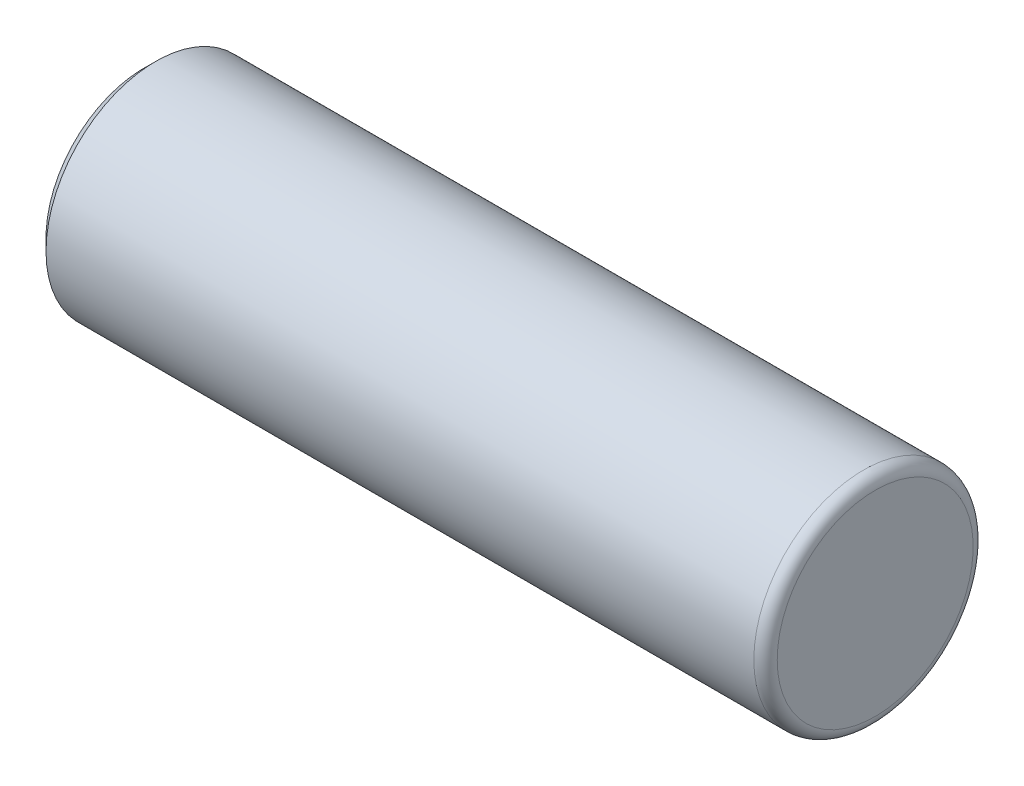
ISO-10303-21;
HEADER;
FILE_DESCRIPTION(('STEP AP214'),'2;1');
FILE_NAME('part.step','',(''),(''),'','','');
FILE_SCHEMA(('AUTOMOTIVE_DESIGN { 1 0 10303 214 1 1 1 1 }'));
ENDSEC;
DATA;
#1=APPLICATION_CONTEXT('core data for automotive mechanical design processes');
#2=APPLICATION_PROTOCOL_DEFINITION('international standard','automotive_design',2000,#1);
#3=PRODUCT_CONTEXT('',#1,'mechanical');
#4=PRODUCT('Part','Part','',(#3));
#5=PRODUCT_RELATED_PRODUCT_CATEGORY('part','',(#4));
#6=PRODUCT_DEFINITION_FORMATION('','',#4);
#7=PRODUCT_DEFINITION_CONTEXT('part definition',#1,'design');
#8=PRODUCT_DEFINITION('design','',#6,#7);
#9=PRODUCT_DEFINITION_SHAPE('','',#8);
#10=(LENGTH_UNIT() NAMED_UNIT(*) SI_UNIT(.MILLI.,.METRE.));
#11=(NAMED_UNIT(*) PLANE_ANGLE_UNIT() SI_UNIT($,.RADIAN.));
#12=(NAMED_UNIT(*) SI_UNIT($,.STERADIAN.) SOLID_ANGLE_UNIT());
#13=UNCERTAINTY_MEASURE_WITH_UNIT(LENGTH_MEASURE(1.E-05),#10,'distance_accuracy_value','');
#14=(GEOMETRIC_REPRESENTATION_CONTEXT(3) GLOBAL_UNCERTAINTY_ASSIGNED_CONTEXT((#13)) GLOBAL_UNIT_ASSIGNED_CONTEXT((#10,
#11,#12)) REPRESENTATION_CONTEXT('',''));
#15=CARTESIAN_POINT('',(0.,0.,0.));
#16=DIRECTION('',(0.,0.,1.));
#17=DIRECTION('',(1.,0.,0.));
#18=AXIS2_PLACEMENT_3D('',#15,#16,#17);
#19=CARTESIAN_POINT('',(-31.75,0.,0.));
#20=DIRECTION('',(1.,0.,0.));
#21=DIRECTION('',(0.,0.,-1.));
#22=AXIS2_PLACEMENT_3D('',#19,#20,#21);
#23=PLANE('',#22);
#24=CARTESIAN_POINT('',(-31.75,0.,0.));
#25=DIRECTION('',(1.,0.,0.));
#26=DIRECTION('',(0.,0.,-1.));
#27=AXIS2_PLACEMENT_3D('',#24,#25,#26);
#28=CIRCLE('',#27,4.2545);
#29=CARTESIAN_POINT('',(-31.75,0.,-4.2545));
#30=VERTEX_POINT('',#29);
#31=EDGE_CURVE('E45',#30,#30,#28,.F.);
#32=ORIENTED_EDGE('',*,*,#31,.T.);
#33=EDGE_LOOP('',(#32));
#34=FACE_BOUND('',#33,.T.);
#35=ADVANCED_FACE('F30',(#34),#23,.F.);
#36=CARTESIAN_POINT('',(-14.1565331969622,0.,0.));
#37=DIRECTION('',(-1.,0.,0.));
#38=DIRECTION('',(0.,0.,1.));
#39=AXIS2_PLACEMENT_3D('',#36,#37,#38);
#40=CYLINDRICAL_SURFACE('',#39,4.7625);
#41=CARTESIAN_POINT('',(-0.508,0.,0.));
#42=DIRECTION('',(-1.,0.,0.));
#43=DIRECTION('',(0.,0.,1.));
#44=AXIS2_PLACEMENT_3D('',#41,#42,#43);
#45=CIRCLE('',#44,4.7625);
#46=CARTESIAN_POINT('',(-0.508,0.,4.7625));
#47=VERTEX_POINT('',#46);
#48=EDGE_CURVE('E37',#47,#47,#45,.T.);
#49=ORIENTED_EDGE('',*,*,#48,.T.);
#50=EDGE_LOOP('',(#49));
#51=FACE_BOUND('',#50,.T.);
#52=CARTESIAN_POINT('',(-31.242,0.,0.));
#53=DIRECTION('',(1.,0.,0.));
#54=DIRECTION('',(0.,0.,-1.));
#55=AXIS2_PLACEMENT_3D('',#52,#53,#54);
#56=CIRCLE('',#55,4.7625);
#57=CARTESIAN_POINT('',(-31.242,0.,-4.7625));
#58=VERTEX_POINT('',#57);
#59=EDGE_CURVE('E41',#58,#58,#56,.T.);
#60=ORIENTED_EDGE('',*,*,#59,.T.);
#61=EDGE_LOOP('',(#60));
#62=FACE_BOUND('',#61,.T.);
#63=ADVANCED_FACE('F61',(#51,#62),#40,.T.);
#64=CARTESIAN_POINT('',(0.,4.7625,0.));
#65=DIRECTION('',(-1.,0.,0.));
#66=DIRECTION('',(0.,0.,1.));
#67=AXIS2_PLACEMENT_3D('',#64,#65,#66);
#68=PLANE('',#67);
#69=CARTESIAN_POINT('',(0.,0.,0.));
#70=DIRECTION('',(-1.,0.,0.));
#71=DIRECTION('',(0.,0.,1.));
#72=AXIS2_PLACEMENT_3D('',#69,#70,#71);
#73=CIRCLE('',#72,4.2545);
#74=CARTESIAN_POINT('',(0.,0.,4.2545));
#75=VERTEX_POINT('',#74);
#76=EDGE_CURVE('E10',#75,#75,#73,.F.);
#77=ORIENTED_EDGE('',*,*,#76,.T.);
#78=EDGE_LOOP('',(#77));
#79=FACE_BOUND('',#78,.T.);
#80=ADVANCED_FACE('F54',(#79),#68,.F.);
#81=CARTESIAN_POINT('',(-31.75,0.,0.));
#82=DIRECTION('',(1.,0.,0.));
#83=DIRECTION('',(0.,0.,-1.));
#84=AXIS2_PLACEMENT_3D('',#81,#82,#83);
#85=CONICAL_SURFACE('',#84,4.2545,0.785398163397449);
#86=ORIENTED_EDGE('',*,*,#59,.F.);
#87=EDGE_LOOP('',(#86));
#88=FACE_BOUND('',#87,.T.);
#89=ORIENTED_EDGE('',*,*,#31,.F.);
#90=EDGE_LOOP('',(#89));
#91=FACE_BOUND('',#90,.T.);
#92=ADVANCED_FACE('F52',(#88,#91),#85,.T.);
#93=CARTESIAN_POINT('',(-0.508,0.,0.));
#94=DIRECTION('',(-1.,0.,0.));
#95=DIRECTION('',(0.,0.,1.));
#96=AXIS2_PLACEMENT_3D('',#93,#94,#95);
#97=TOROIDAL_SURFACE('',#96,4.2545,0.508);
#98=ORIENTED_EDGE('',*,*,#76,.F.);
#99=EDGE_LOOP('',(#98));
#100=FACE_BOUND('',#99,.T.);
#101=ORIENTED_EDGE('',*,*,#48,.F.);
#102=EDGE_LOOP('',(#101));
#103=FACE_BOUND('',#102,.T.);
#104=ADVANCED_FACE('F32',(#100,#103),#97,.T.);
#105=CLOSED_SHELL('',(#35,#63,#80,#92,#104));
#106=MANIFOLD_SOLID_BREP('B2',#105);
#107=ADVANCED_BREP_SHAPE_REPRESENTATION('',(#18,#106),#14);
#108=SHAPE_DEFINITION_REPRESENTATION(#9,#107);
ENDSEC;
END-ISO-10303-21;
